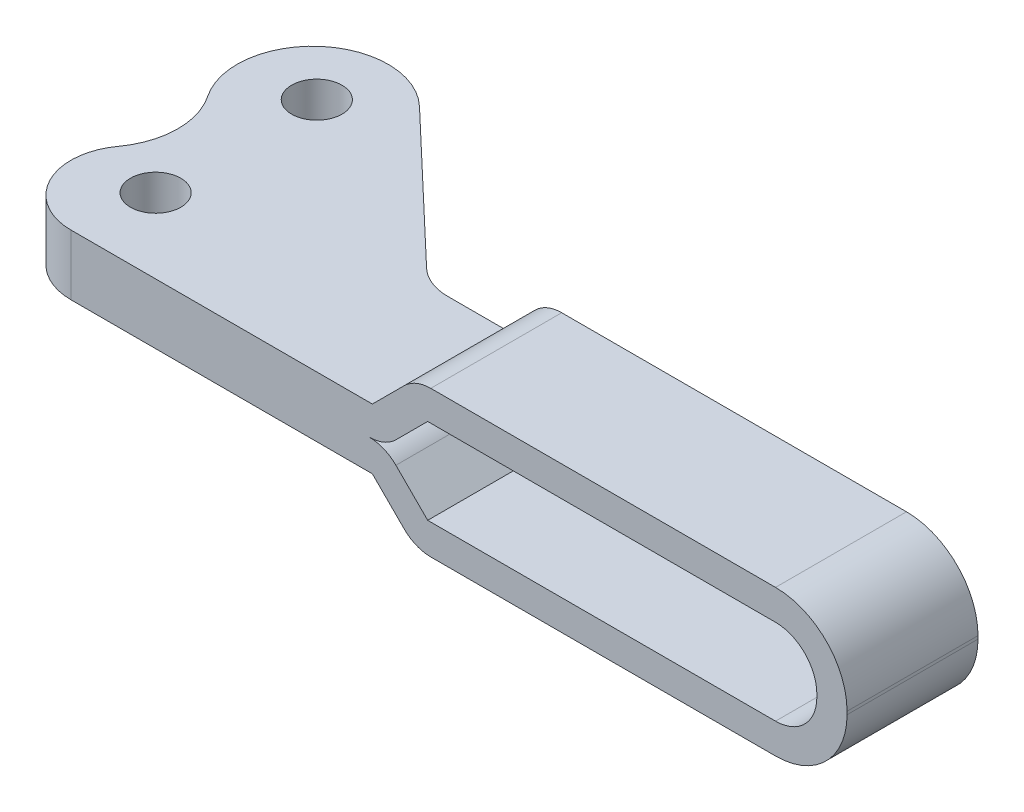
ISO-10303-21;
HEADER;
FILE_DESCRIPTION(('STEP AP214'),'2;1');
FILE_NAME('part.step','',(''),(''),'','','');
FILE_SCHEMA(('AUTOMOTIVE_DESIGN { 1 0 10303 214 1 1 1 1 }'));
ENDSEC;
DATA;
#1=APPLICATION_CONTEXT('core data for automotive mechanical design processes');
#2=APPLICATION_PROTOCOL_DEFINITION('international standard','automotive_design',2000,#1);
#3=PRODUCT_CONTEXT('',#1,'mechanical');
#4=PRODUCT('Part','Part','',(#3));
#5=PRODUCT_RELATED_PRODUCT_CATEGORY('part','',(#4));
#6=PRODUCT_DEFINITION_FORMATION('','',#4);
#7=PRODUCT_DEFINITION_CONTEXT('part definition',#1,'design');
#8=PRODUCT_DEFINITION('design','',#6,#7);
#9=PRODUCT_DEFINITION_SHAPE('','',#8);
#10=(LENGTH_UNIT() NAMED_UNIT(*) SI_UNIT(.MILLI.,.METRE.));
#11=(NAMED_UNIT(*) PLANE_ANGLE_UNIT() SI_UNIT($,.RADIAN.));
#12=(NAMED_UNIT(*) SI_UNIT($,.STERADIAN.) SOLID_ANGLE_UNIT());
#13=UNCERTAINTY_MEASURE_WITH_UNIT(LENGTH_MEASURE(1.E-05),#10,'distance_accuracy_value','');
#14=(GEOMETRIC_REPRESENTATION_CONTEXT(3) GLOBAL_UNCERTAINTY_ASSIGNED_CONTEXT((#13)) GLOBAL_UNIT_ASSIGNED_CONTEXT((#10,
#11,#12)) REPRESENTATION_CONTEXT('',''));
#15=CARTESIAN_POINT('',(0.,0.,0.));
#16=DIRECTION('',(0.,0.,1.));
#17=DIRECTION('',(1.,0.,0.));
#18=AXIS2_PLACEMENT_3D('',#15,#16,#17);
#19=CARTESIAN_POINT('',(-0.999999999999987,3.,1.41));
#20=DIRECTION('',(0.,-1.,0.));
#21=DIRECTION('',(0.,0.,-1.));
#22=AXIS2_PLACEMENT_3D('',#19,#20,#21);
#23=PLANE('',#22);
#24=CARTESIAN_POINT('',(0.,3.,0.));
#25=DIRECTION('',(0.,-1.,0.));
#26=DIRECTION('',(0.,0.,-1.));
#27=AXIS2_PLACEMENT_3D('',#24,#25,#26);
#28=CIRCLE('',#27,2.5);
#29=CARTESIAN_POINT('',(0.,3.,-2.5));
#30=VERTEX_POINT('',#29);
#31=EDGE_CURVE('E722',#30,#30,#28,.T.);
#32=ORIENTED_EDGE('',*,*,#31,.T.);
#33=EDGE_LOOP('',(#32));
#34=FACE_BOUND('',#33,.T.);
#35=CARTESIAN_POINT('',(0.,3.,-16.));
#36=DIRECTION('',(0.,-1.,0.));
#37=DIRECTION('',(0.,0.,-1.));
#38=AXIS2_PLACEMENT_3D('',#35,#36,#37);
#39=CIRCLE('',#38,2.5);
#40=CARTESIAN_POINT('',(0.,3.,-18.5));
#41=VERTEX_POINT('',#40);
#42=EDGE_CURVE('E228',#41,#41,#39,.T.);
#43=ORIENTED_EDGE('',*,*,#42,.T.);
#44=EDGE_LOOP('',(#43));
#45=FACE_BOUND('',#44,.T.);
#46=DIRECTION('',(0.,0.,1.));
#47=VECTOR('',#46,1.);
#48=CARTESIAN_POINT('',(28.9267989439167,3.,7.41));
#49=LINE('',#48,#47);
#50=CARTESIAN_POINT('',(28.9267989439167,3.,-5.59));
#51=VERTEX_POINT('',#50);
#52=CARTESIAN_POINT('',(28.9267989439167,3.,7.41));
#53=VERTEX_POINT('',#52);
#54=EDGE_CURVE('E246',#51,#53,#49,.T.);
#55=ORIENTED_EDGE('',*,*,#54,.F.);
#56=DIRECTION('',(-1.,0.,0.));
#57=VECTOR('',#56,1.);
#58=CARTESIAN_POINT('',(21.3804265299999,3.,-5.59));
#59=LINE('',#58,#57);
#60=CARTESIAN_POINT('',(23.3776196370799,3.,-5.59));
#61=VERTEX_POINT('',#60);
#62=EDGE_CURVE('E260',#51,#61,#59,.T.);
#63=ORIENTED_EDGE('',*,*,#62,.T.);
#64=CARTESIAN_POINT('',(23.3776196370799,3.,-10.59));
#65=DIRECTION('',(0.,-1.,0.));
#66=DIRECTION('',(0.,0.,-1.));
#67=AXIS2_PLACEMENT_3D('',#64,#65,#66);
#68=CIRCLE('',#67,5.);
#69=CARTESIAN_POINT('',(19.9328505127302,3.,-6.96597383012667));
#70=VERTEX_POINT('',#69);
#71=EDGE_CURVE('E364',#61,#70,#68,.T.);
#72=ORIENTED_EDGE('',*,*,#71,.T.);
#73=DIRECTION('',(-0.724805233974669,0.,-0.688953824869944));
#74=VECTOR('',#73,1.);
#75=CARTESIAN_POINT('',(5.6671536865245,3.,-20.5260392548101));
#76=LINE('',#75,#74);
#77=CARTESIAN_POINT('',(5.66715368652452,3.,-20.5260392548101));
#78=VERTEX_POINT('',#77);
#79=EDGE_CURVE('E263',#70,#78,#76,.T.);
#80=ORIENTED_EDGE('',*,*,#79,.T.);
#81=CARTESIAN_POINT('',(0.500000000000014,3.,-15.09));
#82=DIRECTION('',(0.,1.,0.));
#83=DIRECTION('',(0.,0.,-1.));
#84=AXIS2_PLACEMENT_3D('',#81,#82,#83);
#85=CIRCLE('',#84,7.5);
#86=CARTESIAN_POINT('',(-5.70490562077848,3.,-10.8770264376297));
#87=VERTEX_POINT('',#86);
#88=EDGE_CURVE('E266',#78,#87,#85,.T.);
#89=ORIENTED_EDGE('',*,*,#88,.T.);
#90=CARTESIAN_POINT('',(-12.,3.,-6.60281699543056));
#91=DIRECTION('',(0.,-1.,0.));
#92=DIRECTION('',(0.,0.,1.));
#93=AXIS2_PLACEMENT_3D('',#90,#91,#92);
#94=CIRCLE('',#93,7.60901305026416);
#95=CARTESIAN_POINT('',(-5.84972714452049,3.,-2.12272509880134));
#96=VERTEX_POINT('',#95);
#97=EDGE_CURVE('E268',#87,#96,#94,.T.);
#98=ORIENTED_EDGE('',*,*,#97,.T.);
#99=CARTESIAN_POINT('',(-0.999999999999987,3.,1.41));
#100=DIRECTION('',(0.,1.,0.));
#101=DIRECTION('',(0.,0.,-1.));
#102=AXIS2_PLACEMENT_3D('',#99,#100,#101);
#103=CIRCLE('',#102,6.);
#104=CARTESIAN_POINT('',(-0.999999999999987,3.,7.41));
#105=VERTEX_POINT('',#104);
#106=EDGE_CURVE('E270',#96,#105,#103,.T.);
#107=ORIENTED_EDGE('',*,*,#106,.T.);
#108=DIRECTION('',(1.,0.,0.));
#109=VECTOR('',#108,1.);
#110=CARTESIAN_POINT('',(76.0517702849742,3.,7.41));
#111=LINE('',#110,#109);
#112=EDGE_CURVE('E272',#105,#53,#111,.T.);
#113=ORIENTED_EDGE('',*,*,#112,.T.);
#114=EDGE_LOOP('',(#55,#63,#72,#80,#89,#98,#107,#113));
#115=FACE_BOUND('',#114,.T.);
#116=ADVANCED_FACE('F14',(#34,#45,#115),#23,.F.);
#117=CARTESIAN_POINT('',(33.1767989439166,-7.25,-5.59));
#118=DIRECTION('',(0.,-1.,0.));
#119=DIRECTION('',(0.,0.,-1.));
#120=AXIS2_PLACEMENT_3D('',#117,#118,#119);
#121=PLANE('',#120);
#122=DIRECTION('',(1.,0.,0.));
#123=VECTOR('',#122,1.);
#124=CARTESIAN_POINT('',(33.1767989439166,-7.25,-5.59));
#125=LINE('',#124,#123);
#126=CARTESIAN_POINT('',(34.7245493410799,-7.25,-5.59));
#127=VERTEX_POINT('',#126);
#128=CARTESIAN_POINT('',(68.9517702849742,-7.25,-5.59));
#129=VERTEX_POINT('',#128);
#130=EDGE_CURVE('E302',#127,#129,#125,.T.);
#131=ORIENTED_EDGE('',*,*,#130,.T.);
#132=DIRECTION('',(0.,0.,1.));
#133=VECTOR('',#132,1.);
#134=CARTESIAN_POINT('',(68.9517702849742,-7.25,-5.59));
#135=LINE('',#134,#133);
#136=CARTESIAN_POINT('',(68.9517702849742,-7.25,7.41));
#137=VERTEX_POINT('',#136);
#138=EDGE_CURVE('E9',#129,#137,#135,.T.);
#139=ORIENTED_EDGE('',*,*,#138,.T.);
#140=DIRECTION('',(1.,0.,0.));
#141=VECTOR('',#140,1.);
#142=CARTESIAN_POINT('',(33.1767989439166,-7.25,7.41));
#143=LINE('',#142,#141);
#144=CARTESIAN_POINT('',(34.7245493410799,-7.25,7.41));
#145=VERTEX_POINT('',#144);
#146=EDGE_CURVE('E301',#145,#137,#143,.T.);
#147=ORIENTED_EDGE('',*,*,#146,.F.);
#148=DIRECTION('',(0.,0.,1.));
#149=VECTOR('',#148,1.);
#150=CARTESIAN_POINT('',(34.7245493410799,-7.25,-5.59));
#151=LINE('',#150,#149);
#152=EDGE_CURVE('E339',#145,#127,#151,.F.);
#153=ORIENTED_EDGE('',*,*,#152,.T.);
#154=EDGE_LOOP('',(#131,#139,#147,#153));
#155=FACE_BOUND('',#154,.T.);
#156=ADVANCED_FACE('F393',(#155),#121,.T.);
#157=CARTESIAN_POINT('',(28.9267989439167,-3.,-5.59));
#158=DIRECTION('',(-0.707106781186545,-0.70710678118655,0.));
#159=DIRECTION('',(0.707106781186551,-0.707106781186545,0.));
#160=AXIS2_PLACEMENT_3D('',#157,#158,#159);
#161=PLANE('',#160);
#162=DIRECTION('',(0.70710678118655,-0.707106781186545,0.));
#163=VECTOR('',#162,1.);
#164=CARTESIAN_POINT('',(28.9267989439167,-3.,-5.59));
#165=LINE('',#164,#163);
#166=CARTESIAN_POINT('',(28.9267989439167,-3.,-5.59));
#167=VERTEX_POINT('',#166);
#168=CARTESIAN_POINT('',(32.0823741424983,-6.15557519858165,-5.59));
#169=VERTEX_POINT('',#168);
#170=EDGE_CURVE('E308',#167,#169,#165,.T.);
#171=ORIENTED_EDGE('',*,*,#170,.T.);
#172=DIRECTION('',(0.,0.,1.));
#173=VECTOR('',#172,1.);
#174=CARTESIAN_POINT('',(32.0823741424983,-6.15557519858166,-5.59));
#175=LINE('',#174,#173);
#176=CARTESIAN_POINT('',(32.0823741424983,-6.15557519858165,7.41));
#177=VERTEX_POINT('',#176);
#178=EDGE_CURVE('E336',#169,#177,#175,.T.);
#179=ORIENTED_EDGE('',*,*,#178,.T.);
#180=DIRECTION('',(0.70710678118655,-0.707106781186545,0.));
#181=VECTOR('',#180,1.);
#182=CARTESIAN_POINT('',(28.9267989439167,-3.,7.41));
#183=LINE('',#182,#181);
#184=CARTESIAN_POINT('',(28.9267989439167,-3.,7.41));
#185=VERTEX_POINT('',#184);
#186=EDGE_CURVE('E306',#185,#177,#183,.T.);
#187=ORIENTED_EDGE('',*,*,#186,.F.);
#188=DIRECTION('',(0.,0.,1.));
#189=VECTOR('',#188,1.);
#190=CARTESIAN_POINT('',(28.9267989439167,-3.,-5.59));
#191=LINE('',#190,#189);
#192=EDGE_CURVE('E311',#167,#185,#191,.T.);
#193=ORIENTED_EDGE('',*,*,#192,.F.);
#194=EDGE_LOOP('',(#171,#179,#187,#193));
#195=FACE_BOUND('',#194,.T.);
#196=ADVANCED_FACE('F402',(#195),#161,.T.);
#197=CARTESIAN_POINT('',(76.0517702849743,-7.25,-5.59));
#198=DIRECTION('',(1.,0.,0.));
#199=DIRECTION('',(0.,1.,0.));
#200=AXIS2_PLACEMENT_3D('',#197,#198,#199);
#201=PLANE('',#200);
#202=DIRECTION('',(0.,1.,0.));
#203=VECTOR('',#202,1.);
#204=CARTESIAN_POINT('',(76.0517702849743,-7.25,-5.59));
#205=LINE('',#204,#203);
#206=CARTESIAN_POINT('',(76.0517702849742,-0.149999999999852,-5.59));
#207=VERTEX_POINT('',#206);
#208=CARTESIAN_POINT('',(76.0517702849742,0.15000000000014,-5.59));
#209=VERTEX_POINT('',#208);
#210=EDGE_CURVE('E305',#207,#209,#205,.T.);
#211=ORIENTED_EDGE('',*,*,#210,.T.);
#212=DIRECTION('',(0.,0.,-1.));
#213=VECTOR('',#212,1.);
#214=CARTESIAN_POINT('',(76.0517702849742,0.150000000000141,7.41));
#215=LINE('',#214,#213);
#216=CARTESIAN_POINT('',(76.0517702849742,0.15000000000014,7.41));
#217=VERTEX_POINT('',#216);
#218=EDGE_CURVE('E36',#209,#217,#215,.F.);
#219=ORIENTED_EDGE('',*,*,#218,.T.);
#220=DIRECTION('',(0.,1.,0.));
#221=VECTOR('',#220,1.);
#222=CARTESIAN_POINT('',(76.0517702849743,-7.25,7.41));
#223=LINE('',#222,#221);
#224=CARTESIAN_POINT('',(76.0517702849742,-0.149999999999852,7.41));
#225=VERTEX_POINT('',#224);
#226=EDGE_CURVE('E314',#225,#217,#223,.T.);
#227=ORIENTED_EDGE('',*,*,#226,.F.);
#228=DIRECTION('',(0.,0.,1.));
#229=VECTOR('',#228,1.);
#230=CARTESIAN_POINT('',(76.0517702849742,-0.149999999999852,-5.59));
#231=LINE('',#230,#229);
#232=EDGE_CURVE('E373',#225,#207,#231,.F.);
#233=ORIENTED_EDGE('',*,*,#232,.T.);
#234=EDGE_LOOP('',(#211,#219,#227,#233));
#235=FACE_BOUND('',#234,.T.);
#236=ADVANCED_FACE('F389',(#235),#201,.T.);
#237=CARTESIAN_POINT('',(0.,0.,-5.59));
#238=DIRECTION('',(0.,0.,1.));
#239=DIRECTION('',(1.,0.,0.));
#240=AXIS2_PLACEMENT_3D('',#237,#238,#239);
#241=PLANE('',#240);
#242=DIRECTION('',(-0.70710678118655,0.707106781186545,0.));
#243=VECTOR('',#242,1.);
#244=CARTESIAN_POINT('',(34.4194396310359,-4.25,-5.59));
#245=LINE('',#244,#243);
#246=CARTESIAN_POINT('',(34.4194396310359,-4.25,-5.59));
#247=VERTEX_POINT('',#246);
#248=CARTESIAN_POINT('',(31.2638644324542,-1.09442480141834,-5.59));
#249=VERTEX_POINT('',#248);
#250=EDGE_CURVE('E227',#247,#249,#245,.T.);
#251=ORIENTED_EDGE('',*,*,#250,.F.);
#252=DIRECTION('',(-1.,0.,0.));
#253=VECTOR('',#252,1.);
#254=CARTESIAN_POINT('',(73.0517702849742,-4.25,-5.59));
#255=LINE('',#254,#253);
#256=CARTESIAN_POINT('',(68.9517702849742,-4.25,-5.59));
#257=VERTEX_POINT('',#256);
#258=EDGE_CURVE('E202',#257,#247,#255,.T.);
#259=ORIENTED_EDGE('',*,*,#258,.F.);
#260=CARTESIAN_POINT('',(68.9517702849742,-0.15,-5.59));
#261=DIRECTION('',(0.,0.,1.));
#262=DIRECTION('',(1.,0.,0.));
#263=AXIS2_PLACEMENT_3D('',#260,#261,#262);
#264=CIRCLE('',#263,4.1);
#265=CARTESIAN_POINT('',(73.0517702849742,-0.15,-5.59));
#266=VERTEX_POINT('',#265);
#267=EDGE_CURVE('E350',#257,#266,#264,.T.);
#268=ORIENTED_EDGE('',*,*,#267,.T.);
#269=DIRECTION('',(0.,-1.,0.));
#270=VECTOR('',#269,1.);
#271=CARTESIAN_POINT('',(73.0517702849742,4.25,-5.59));
#272=LINE('',#271,#270);
#273=CARTESIAN_POINT('',(73.0517702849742,0.149999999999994,-5.59));
#274=VERTEX_POINT('',#273);
#275=EDGE_CURVE('E196',#274,#266,#272,.T.);
#276=ORIENTED_EDGE('',*,*,#275,.F.);
#277=CARTESIAN_POINT('',(68.9517702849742,0.149999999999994,-5.59));
#278=DIRECTION('',(0.,0.,1.));
#279=DIRECTION('',(1.,0.,0.));
#280=AXIS2_PLACEMENT_3D('',#277,#278,#279);
#281=CIRCLE('',#280,4.1);
#282=CARTESIAN_POINT('',(68.9517702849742,4.25,-5.59));
#283=VERTEX_POINT('',#282);
#284=EDGE_CURVE('E353',#274,#283,#281,.T.);
#285=ORIENTED_EDGE('',*,*,#284,.T.);
#286=DIRECTION('',(1.,0.,0.));
#287=VECTOR('',#286,1.);
#288=CARTESIAN_POINT('',(34.4194396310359,4.25,-5.59));
#289=LINE('',#288,#287);
#290=CARTESIAN_POINT('',(34.4194396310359,4.25,-5.59));
#291=VERTEX_POINT('',#290);
#292=EDGE_CURVE('E239',#291,#283,#289,.T.);
#293=ORIENTED_EDGE('',*,*,#292,.F.);
#294=DIRECTION('',(0.707106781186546,0.707106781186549,0.));
#295=VECTOR('',#294,1.);
#296=CARTESIAN_POINT('',(31.2638644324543,1.09442480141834,-5.59));
#297=LINE('',#296,#295);
#298=CARTESIAN_POINT('',(31.2638644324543,1.09442480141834,-5.59));
#299=VERTEX_POINT('',#298);
#300=EDGE_CURVE('E236',#299,#291,#297,.T.);
#301=ORIENTED_EDGE('',*,*,#300,.F.);
#302=CARTESIAN_POINT('',(28.6216892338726,3.7366,-5.59));
#303=DIRECTION('',(0.,0.,1.));
#304=DIRECTION('',(1.,0.,0.));
#305=AXIS2_PLACEMENT_3D('',#302,#303,#304);
#306=CIRCLE('',#305,3.7366);
#307=CARTESIAN_POINT('',(28.6216892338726,0.,-5.59));
#308=VERTEX_POINT('',#307);
#309=EDGE_CURVE('E233',#308,#299,#306,.T.);
#310=ORIENTED_EDGE('',*,*,#309,.F.);
#311=CARTESIAN_POINT('',(28.6216892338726,-3.7366,-5.59));
#312=DIRECTION('',(0.,0.,1.));
#313=DIRECTION('',(1.,0.,0.));
#314=AXIS2_PLACEMENT_3D('',#311,#312,#313);
#315=CIRCLE('',#314,3.7366);
#316=EDGE_CURVE('E230',#249,#308,#315,.T.);
#317=ORIENTED_EDGE('',*,*,#316,.F.);
#318=EDGE_LOOP('',(#251,#259,#268,#276,#285,#293,#301,#310,#317));
#319=FACE_BOUND('',#318,.T.);
#320=DIRECTION('',(-1.,0.,0.));
#321=VECTOR('',#320,1.);
#322=CARTESIAN_POINT('',(28.9267989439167,7.25,-5.59));
#323=LINE('',#322,#321);
#324=CARTESIAN_POINT('',(68.9517702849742,7.25,-5.59));
#325=VERTEX_POINT('',#324);
#326=CARTESIAN_POINT('',(34.72454934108,7.25,-5.59));
#327=VERTEX_POINT('',#326);
#328=EDGE_CURVE('E255',#325,#327,#323,.T.);
#329=ORIENTED_EDGE('',*,*,#328,.F.);
#330=CARTESIAN_POINT('',(68.9517702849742,0.15,-5.59));
#331=DIRECTION('',(0.,0.,1.));
#332=DIRECTION('',(1.,0.,0.));
#333=AXIS2_PLACEMENT_3D('',#330,#331,#332);
#334=CIRCLE('',#333,7.1);
#335=EDGE_CURVE('E371',#325,#209,#334,.F.);
#336=ORIENTED_EDGE('',*,*,#335,.T.);
#337=ORIENTED_EDGE('',*,*,#210,.F.);
#338=CARTESIAN_POINT('',(68.9517702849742,-0.14999999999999,-5.59));
#339=DIRECTION('',(0.,0.,1.));
#340=DIRECTION('',(1.,0.,0.));
#341=AXIS2_PLACEMENT_3D('',#338,#339,#340);
#342=CIRCLE('',#341,7.1);
#343=EDGE_CURVE('E369',#207,#129,#342,.F.);
#344=ORIENTED_EDGE('',*,*,#343,.T.);
#345=ORIENTED_EDGE('',*,*,#130,.F.);
#346=CARTESIAN_POINT('',(34.7245493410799,-3.5134,-5.59));
#347=DIRECTION('',(0.,0.,1.));
#348=DIRECTION('',(1.,0.,0.));
#349=AXIS2_PLACEMENT_3D('',#346,#347,#348);
#350=CIRCLE('',#349,3.7366);
#351=EDGE_CURVE('E331',#127,#169,#350,.F.);
#352=ORIENTED_EDGE('',*,*,#351,.T.);
#353=ORIENTED_EDGE('',*,*,#170,.F.);
#354=DIRECTION('',(-1.,0.,0.));
#355=VECTOR('',#354,1.);
#356=CARTESIAN_POINT('',(21.3804265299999,-3.,-5.59));
#357=LINE('',#356,#355);
#358=CARTESIAN_POINT('',(23.3776196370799,-3.,-5.59));
#359=VERTEX_POINT('',#358);
#360=EDGE_CURVE('E276',#167,#359,#357,.T.);
#361=ORIENTED_EDGE('',*,*,#360,.T.);
#362=DIRECTION('',(0.,-1.,0.));
#363=VECTOR('',#362,1.);
#364=CARTESIAN_POINT('',(23.3776196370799,3.,-5.59));
#365=LINE('',#364,#363);
#366=EDGE_CURVE('E360',#359,#61,#365,.F.);
#367=ORIENTED_EDGE('',*,*,#366,.T.);
#368=ORIENTED_EDGE('',*,*,#62,.F.);
#369=DIRECTION('',(0.707106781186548,0.707106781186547,0.));
#370=VECTOR('',#369,1.);
#371=CARTESIAN_POINT('',(28.9267989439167,3.,-5.59));
#372=LINE('',#371,#370);
#373=CARTESIAN_POINT('',(32.0823741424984,6.15557519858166,-5.59));
#374=VERTEX_POINT('',#373);
#375=EDGE_CURVE('E257',#374,#51,#372,.F.);
#376=ORIENTED_EDGE('',*,*,#375,.F.);
#377=CARTESIAN_POINT('',(34.72454934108,3.5134,-5.59));
#378=DIRECTION('',(0.,0.,1.));
#379=DIRECTION('',(1.,0.,0.));
#380=AXIS2_PLACEMENT_3D('',#377,#378,#379);
#381=CIRCLE('',#380,3.7366);
#382=EDGE_CURVE('E333',#374,#327,#381,.F.);
#383=ORIENTED_EDGE('',*,*,#382,.T.);
#384=EDGE_LOOP('',(#329,#336,#337,#344,#345,#352,#353,#361,#367,#368,#376,#383));
#385=FACE_BOUND('',#384,.T.);
#386=ADVANCED_FACE('F387',(#319,#385),#241,.F.);
#387=CARTESIAN_POINT('',(0.,0.,7.41));
#388=DIRECTION('',(0.,0.,1.));
#389=DIRECTION('',(1.,0.,0.));
#390=AXIS2_PLACEMENT_3D('',#387,#388,#389);
#391=PLANE('',#390);
#392=DIRECTION('',(0.,-1.,0.));
#393=VECTOR('',#392,1.);
#394=CARTESIAN_POINT('',(73.0517702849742,4.25,7.41));
#395=LINE('',#394,#393);
#396=CARTESIAN_POINT('',(73.0517702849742,0.149999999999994,7.41));
#397=VERTEX_POINT('',#396);
#398=CARTESIAN_POINT('',(73.0517702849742,-0.15,7.41));
#399=VERTEX_POINT('',#398);
#400=EDGE_CURVE('E207',#397,#399,#395,.T.);
#401=ORIENTED_EDGE('',*,*,#400,.T.);
#402=CARTESIAN_POINT('',(68.9517702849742,-0.15,7.41));
#403=DIRECTION('',(0.,0.,1.));
#404=DIRECTION('',(1.,0.,0.));
#405=AXIS2_PLACEMENT_3D('',#402,#403,#404);
#406=CIRCLE('',#405,4.1);
#407=CARTESIAN_POINT('',(68.9517702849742,-4.25,7.41));
#408=VERTEX_POINT('',#407);
#409=EDGE_CURVE('E192',#399,#408,#406,.F.);
#410=ORIENTED_EDGE('',*,*,#409,.T.);
#411=DIRECTION('',(-1.,0.,0.));
#412=VECTOR('',#411,1.);
#413=CARTESIAN_POINT('',(73.0517702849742,-4.25,7.41));
#414=LINE('',#413,#412);
#415=CARTESIAN_POINT('',(34.4194396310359,-4.25,7.41));
#416=VERTEX_POINT('',#415);
#417=EDGE_CURVE('E183',#408,#416,#414,.T.);
#418=ORIENTED_EDGE('',*,*,#417,.T.);
#419=DIRECTION('',(-0.70710678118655,0.707106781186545,0.));
#420=VECTOR('',#419,1.);
#421=CARTESIAN_POINT('',(34.4194396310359,-4.25,7.41));
#422=LINE('',#421,#420);
#423=CARTESIAN_POINT('',(31.2638644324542,-1.09442480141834,7.41));
#424=VERTEX_POINT('',#423);
#425=EDGE_CURVE('E190',#416,#424,#422,.T.);
#426=ORIENTED_EDGE('',*,*,#425,.T.);
#427=CARTESIAN_POINT('',(28.6216892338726,-3.7366,7.41));
#428=DIRECTION('',(0.,0.,1.));
#429=DIRECTION('',(1.,0.,0.));
#430=AXIS2_PLACEMENT_3D('',#427,#428,#429);
#431=CIRCLE('',#430,3.7366);
#432=CARTESIAN_POINT('',(28.6216892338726,0.,7.41));
#433=VERTEX_POINT('',#432);
#434=EDGE_CURVE('E211',#424,#433,#431,.T.);
#435=ORIENTED_EDGE('',*,*,#434,.T.);
#436=CARTESIAN_POINT('',(28.6216892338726,3.7366,7.41));
#437=DIRECTION('',(0.,0.,1.));
#438=DIRECTION('',(1.,0.,0.));
#439=AXIS2_PLACEMENT_3D('',#436,#437,#438);
#440=CIRCLE('',#439,3.7366);
#441=CARTESIAN_POINT('',(31.2638644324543,1.09442480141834,7.41));
#442=VERTEX_POINT('',#441);
#443=EDGE_CURVE('E213',#433,#442,#440,.T.);
#444=ORIENTED_EDGE('',*,*,#443,.T.);
#445=DIRECTION('',(0.707106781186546,0.707106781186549,0.));
#446=VECTOR('',#445,1.);
#447=CARTESIAN_POINT('',(31.2638644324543,1.09442480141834,7.41));
#448=LINE('',#447,#446);
#449=CARTESIAN_POINT('',(34.4194396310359,4.25,7.41));
#450=VERTEX_POINT('',#449);
#451=EDGE_CURVE('E219',#442,#450,#448,.T.);
#452=ORIENTED_EDGE('',*,*,#451,.T.);
#453=DIRECTION('',(1.,0.,0.));
#454=VECTOR('',#453,1.);
#455=CARTESIAN_POINT('',(34.4194396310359,4.25,7.41));
#456=LINE('',#455,#454);
#457=CARTESIAN_POINT('',(68.9517702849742,4.25,7.41));
#458=VERTEX_POINT('',#457);
#459=EDGE_CURVE('E222',#450,#458,#456,.T.);
#460=ORIENTED_EDGE('',*,*,#459,.T.);
#461=CARTESIAN_POINT('',(68.9517702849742,0.149999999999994,7.41));
#462=DIRECTION('',(0.,0.,1.));
#463=DIRECTION('',(1.,0.,0.));
#464=AXIS2_PLACEMENT_3D('',#461,#462,#463);
#465=CIRCLE('',#464,4.1);
#466=EDGE_CURVE('E355',#458,#397,#465,.F.);
#467=ORIENTED_EDGE('',*,*,#466,.T.);
#468=EDGE_LOOP('',(#401,#410,#418,#426,#435,#444,#452,#460,#467));
#469=FACE_BOUND('',#468,.T.);
#470=ORIENTED_EDGE('',*,*,#226,.T.);
#471=CARTESIAN_POINT('',(68.9517702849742,0.15,7.41));
#472=DIRECTION('',(0.,0.,1.));
#473=DIRECTION('',(1.,0.,0.));
#474=AXIS2_PLACEMENT_3D('',#471,#472,#473);
#475=CIRCLE('',#474,7.1);
#476=CARTESIAN_POINT('',(68.9517702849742,7.25,7.41));
#477=VERTEX_POINT('',#476);
#478=EDGE_CURVE('E22',#217,#477,#475,.T.);
#479=ORIENTED_EDGE('',*,*,#478,.T.);
#480=DIRECTION('',(1.,0.,0.));
#481=VECTOR('',#480,1.);
#482=CARTESIAN_POINT('',(76.0517702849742,7.25,7.41));
#483=LINE('',#482,#481);
#484=CARTESIAN_POINT('',(34.72454934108,7.25,7.41));
#485=VERTEX_POINT('',#484);
#486=EDGE_CURVE('E252',#485,#477,#483,.T.);
#487=ORIENTED_EDGE('',*,*,#486,.F.);
#488=CARTESIAN_POINT('',(34.72454934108,3.5134,7.41));
#489=DIRECTION('',(0.,0.,1.));
#490=DIRECTION('',(1.,0.,0.));
#491=AXIS2_PLACEMENT_3D('',#488,#489,#490);
#492=CIRCLE('',#491,3.7366);
#493=CARTESIAN_POINT('',(32.0823741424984,6.15557519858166,7.41));
#494=VERTEX_POINT('',#493);
#495=EDGE_CURVE('E327',#485,#494,#492,.T.);
#496=ORIENTED_EDGE('',*,*,#495,.T.);
#497=DIRECTION('',(0.707106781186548,0.707106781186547,0.));
#498=VECTOR('',#497,1.);
#499=CARTESIAN_POINT('',(28.9267989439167,3.,7.41));
#500=LINE('',#499,#498);
#501=EDGE_CURVE('E280',#494,#53,#500,.F.);
#502=ORIENTED_EDGE('',*,*,#501,.T.);
#503=ORIENTED_EDGE('',*,*,#112,.F.);
#504=DIRECTION('',(0.,-1.,0.));
#505=VECTOR('',#504,1.);
#506=CARTESIAN_POINT('',(-0.999999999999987,3.,7.41));
#507=LINE('',#506,#505);
#508=CARTESIAN_POINT('',(-0.999999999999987,-3.,7.41));
#509=VERTEX_POINT('',#508);
#510=EDGE_CURVE('E275',#105,#509,#507,.T.);
#511=ORIENTED_EDGE('',*,*,#510,.T.);
#512=DIRECTION('',(1.,0.,0.));
#513=VECTOR('',#512,1.);
#514=CARTESIAN_POINT('',(76.0517702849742,-3.,7.41));
#515=LINE('',#514,#513);
#516=EDGE_CURVE('E264',#509,#185,#515,.T.);
#517=ORIENTED_EDGE('',*,*,#516,.T.);
#518=ORIENTED_EDGE('',*,*,#186,.T.);
#519=CARTESIAN_POINT('',(34.7245493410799,-3.5134,7.41));
#520=DIRECTION('',(0.,0.,1.));
#521=DIRECTION('',(1.,0.,0.));
#522=AXIS2_PLACEMENT_3D('',#519,#520,#521);
#523=CIRCLE('',#522,3.7366);
#524=EDGE_CURVE('E325',#177,#145,#523,.T.);
#525=ORIENTED_EDGE('',*,*,#524,.T.);
#526=ORIENTED_EDGE('',*,*,#146,.T.);
#527=CARTESIAN_POINT('',(68.9517702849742,-0.14999999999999,7.41));
#528=DIRECTION('',(0.,0.,1.));
#529=DIRECTION('',(1.,0.,0.));
#530=AXIS2_PLACEMENT_3D('',#527,#528,#529);
#531=CIRCLE('',#530,7.1);
#532=EDGE_CURVE('E29',#137,#225,#531,.T.);
#533=ORIENTED_EDGE('',*,*,#532,.T.);
#534=EDGE_LOOP('',(#470,#479,#487,#496,#502,#503,#511,#517,#518,#525,#526,#533));
#535=FACE_BOUND('',#534,.T.);
#536=ADVANCED_FACE('F186',(#469,#535),#391,.T.);
#537=CARTESIAN_POINT('',(5.6671536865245,3.,-20.5260392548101));
#538=DIRECTION('',(-0.688953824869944,0.,0.724805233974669));
#539=DIRECTION('',(0.724805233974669,0.,0.688953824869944));
#540=AXIS2_PLACEMENT_3D('',#537,#538,#539);
#541=PLANE('',#540);
#542=ORIENTED_EDGE('',*,*,#79,.F.);
#543=DIRECTION('',(0.,-1.,0.));
#544=VECTOR('',#543,1.);
#545=CARTESIAN_POINT('',(19.9328505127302,-3.,-6.96597383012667));
#546=LINE('',#545,#544);
#547=CARTESIAN_POINT('',(19.9328505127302,-3.,-6.96597383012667));
#548=VERTEX_POINT('',#547);
#549=EDGE_CURVE('E357',#70,#548,#546,.T.);
#550=ORIENTED_EDGE('',*,*,#549,.T.);
#551=DIRECTION('',(-0.724805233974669,0.,-0.688953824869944));
#552=VECTOR('',#551,1.);
#553=CARTESIAN_POINT('',(5.6671536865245,-3.,-20.5260392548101));
#554=LINE('',#553,#552);
#555=CARTESIAN_POINT('',(5.66715368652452,-3.,-20.5260392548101));
#556=VERTEX_POINT('',#555);
#557=EDGE_CURVE('E279',#548,#556,#554,.T.);
#558=ORIENTED_EDGE('',*,*,#557,.T.);
#559=DIRECTION('',(0.,-1.,0.));
#560=VECTOR('',#559,1.);
#561=CARTESIAN_POINT('',(5.66715368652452,3.,-20.5260392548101));
#562=LINE('',#561,#560);
#563=EDGE_CURVE('E298',#78,#556,#562,.T.);
#564=ORIENTED_EDGE('',*,*,#563,.F.);
#565=EDGE_LOOP('',(#542,#550,#558,#564));
#566=FACE_BOUND('',#565,.T.);
#567=ADVANCED_FACE('F426',(#566),#541,.F.);
#568=CARTESIAN_POINT('',(0.500000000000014,3.,-15.09));
#569=DIRECTION('',(0.,-1.,0.));
#570=DIRECTION('',(0.,0.,-1.));
#571=AXIS2_PLACEMENT_3D('',#568,#569,#570);
#572=CYLINDRICAL_SURFACE('',#571,7.5);
#573=CARTESIAN_POINT('',(0.500000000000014,-3.,-15.09));
#574=DIRECTION('',(0.,1.,0.));
#575=DIRECTION('',(0.,0.,-1.));
#576=AXIS2_PLACEMENT_3D('',#573,#574,#575);
#577=CIRCLE('',#576,7.5);
#578=CARTESIAN_POINT('',(-5.70490562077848,-3.,-10.8770264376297));
#579=VERTEX_POINT('',#578);
#580=EDGE_CURVE('E282',#556,#579,#577,.T.);
#581=ORIENTED_EDGE('',*,*,#580,.T.);
#582=DIRECTION('',(0.,-1.,0.));
#583=VECTOR('',#582,1.);
#584=CARTESIAN_POINT('',(-5.70490562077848,3.,-10.8770264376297));
#585=LINE('',#584,#583);
#586=EDGE_CURVE('E295',#87,#579,#585,.T.);
#587=ORIENTED_EDGE('',*,*,#586,.F.);
#588=ORIENTED_EDGE('',*,*,#88,.F.);
#589=ORIENTED_EDGE('',*,*,#563,.T.);
#590=EDGE_LOOP('',(#581,#587,#588,#589));
#591=FACE_BOUND('',#590,.T.);
#592=ADVANCED_FACE('F422',(#591),#572,.T.);
#593=CARTESIAN_POINT('',(-12.,3.,-6.60281699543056));
#594=DIRECTION('',(0.,-1.,0.));
#595=DIRECTION('',(0.,0.,-1.));
#596=AXIS2_PLACEMENT_3D('',#593,#594,#595);
#597=CYLINDRICAL_SURFACE('',#596,7.60901305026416);
#598=CARTESIAN_POINT('',(-12.,-3.,-6.60281699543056));
#599=DIRECTION('',(0.,-1.,0.));
#600=DIRECTION('',(0.,0.,1.));
#601=AXIS2_PLACEMENT_3D('',#598,#599,#600);
#602=CIRCLE('',#601,7.60901305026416);
#603=CARTESIAN_POINT('',(-5.84972714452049,-3.,-2.12272509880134));
#604=VERTEX_POINT('',#603);
#605=EDGE_CURVE('E284',#579,#604,#602,.T.);
#606=ORIENTED_EDGE('',*,*,#605,.T.);
#607=DIRECTION('',(0.,-1.,0.));
#608=VECTOR('',#607,1.);
#609=CARTESIAN_POINT('',(-5.84972714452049,3.,-2.12272509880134));
#610=LINE('',#609,#608);
#611=EDGE_CURVE('E292',#96,#604,#610,.T.);
#612=ORIENTED_EDGE('',*,*,#611,.F.);
#613=ORIENTED_EDGE('',*,*,#97,.F.);
#614=ORIENTED_EDGE('',*,*,#586,.T.);
#615=EDGE_LOOP('',(#606,#612,#613,#614));
#616=FACE_BOUND('',#615,.T.);
#617=ADVANCED_FACE('F417',(#616),#597,.F.);
#618=CARTESIAN_POINT('',(-0.999999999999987,3.,1.41));
#619=DIRECTION('',(0.,-1.,0.));
#620=DIRECTION('',(0.,0.,-1.));
#621=AXIS2_PLACEMENT_3D('',#618,#619,#620);
#622=CYLINDRICAL_SURFACE('',#621,6.);
#623=CARTESIAN_POINT('',(-0.999999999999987,-3.,1.41));
#624=DIRECTION('',(0.,1.,0.));
#625=DIRECTION('',(0.,0.,-1.));
#626=AXIS2_PLACEMENT_3D('',#623,#624,#625);
#627=CIRCLE('',#626,6.);
#628=EDGE_CURVE('E286',#604,#509,#627,.T.);
#629=ORIENTED_EDGE('',*,*,#628,.T.);
#630=ORIENTED_EDGE('',*,*,#510,.F.);
#631=ORIENTED_EDGE('',*,*,#106,.F.);
#632=ORIENTED_EDGE('',*,*,#611,.T.);
#633=EDGE_LOOP('',(#629,#630,#631,#632));
#634=FACE_BOUND('',#633,.T.);
#635=ADVANCED_FACE('F411',(#634),#622,.T.);
#636=CARTESIAN_POINT('',(-0.999999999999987,-3.,1.41));
#637=DIRECTION('',(0.,-1.,0.));
#638=DIRECTION('',(0.,0.,-1.));
#639=AXIS2_PLACEMENT_3D('',#636,#637,#638);
#640=PLANE('',#639);
#641=CARTESIAN_POINT('',(0.,-3.,0.));
#642=DIRECTION('',(0.,-1.,0.));
#643=DIRECTION('',(0.,0.,-1.));
#644=AXIS2_PLACEMENT_3D('',#641,#642,#643);
#645=CIRCLE('',#644,2.5);
#646=CARTESIAN_POINT('',(0.,-3.,-2.5));
#647=VERTEX_POINT('',#646);
#648=EDGE_CURVE('E720',#647,#647,#645,.T.);
#649=ORIENTED_EDGE('',*,*,#648,.F.);
#650=EDGE_LOOP('',(#649));
#651=FACE_BOUND('',#650,.T.);
#652=CARTESIAN_POINT('',(0.,-3.,-16.));
#653=DIRECTION('',(0.,-1.,0.));
#654=DIRECTION('',(0.,0.,-1.));
#655=AXIS2_PLACEMENT_3D('',#652,#653,#654);
#656=CIRCLE('',#655,2.5);
#657=CARTESIAN_POINT('',(0.,-3.,-18.5));
#658=VERTEX_POINT('',#657);
#659=EDGE_CURVE('E723',#658,#658,#656,.T.);
#660=ORIENTED_EDGE('',*,*,#659,.F.);
#661=EDGE_LOOP('',(#660));
#662=FACE_BOUND('',#661,.T.);
#663=ORIENTED_EDGE('',*,*,#360,.F.);
#664=ORIENTED_EDGE('',*,*,#192,.T.);
#665=ORIENTED_EDGE('',*,*,#516,.F.);
#666=ORIENTED_EDGE('',*,*,#628,.F.);
#667=ORIENTED_EDGE('',*,*,#605,.F.);
#668=ORIENTED_EDGE('',*,*,#580,.F.);
#669=ORIENTED_EDGE('',*,*,#557,.F.);
#670=CARTESIAN_POINT('',(23.3776196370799,-3.,-10.59));
#671=DIRECTION('',(0.,-1.,0.));
#672=DIRECTION('',(0.,0.,-1.));
#673=AXIS2_PLACEMENT_3D('',#670,#671,#672);
#674=CIRCLE('',#673,5.);
#675=EDGE_CURVE('E362',#548,#359,#674,.F.);
#676=ORIENTED_EDGE('',*,*,#675,.T.);
#677=EDGE_LOOP('',(#663,#664,#665,#666,#667,#668,#669,#676));
#678=FACE_BOUND('',#677,.T.);
#679=ADVANCED_FACE('F405',(#651,#662,#678),#640,.T.);
#680=CARTESIAN_POINT('',(28.9267989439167,3.,7.41));
#681=DIRECTION('',(-0.707106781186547,0.707106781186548,0.));
#682=DIRECTION('',(-0.707106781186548,-0.707106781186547,0.));
#683=AXIS2_PLACEMENT_3D('',#680,#681,#682);
#684=PLANE('',#683);
#685=ORIENTED_EDGE('',*,*,#501,.F.);
#686=DIRECTION('',(0.,0.,1.));
#687=VECTOR('',#686,1.);
#688=CARTESIAN_POINT('',(32.0823741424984,6.15557519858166,7.41));
#689=LINE('',#688,#687);
#690=EDGE_CURVE('E329',#494,#374,#689,.F.);
#691=ORIENTED_EDGE('',*,*,#690,.T.);
#692=ORIENTED_EDGE('',*,*,#375,.T.);
#693=ORIENTED_EDGE('',*,*,#54,.T.);
#694=EDGE_LOOP('',(#685,#691,#692,#693));
#695=FACE_BOUND('',#694,.T.);
#696=ADVANCED_FACE('F442',(#695),#684,.T.);
#697=CARTESIAN_POINT('',(0.,7.25,0.));
#698=DIRECTION('',(0.,-1.,0.));
#699=DIRECTION('',(0.,0.,-1.));
#700=AXIS2_PLACEMENT_3D('',#697,#698,#699);
#701=PLANE('',#700);
#702=ORIENTED_EDGE('',*,*,#486,.T.);
#703=DIRECTION('',(0.,0.,-1.));
#704=VECTOR('',#703,1.);
#705=CARTESIAN_POINT('',(68.9517702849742,7.25,-5.59));
#706=LINE('',#705,#704);
#707=EDGE_CURVE('E366',#477,#325,#706,.T.);
#708=ORIENTED_EDGE('',*,*,#707,.T.);
#709=ORIENTED_EDGE('',*,*,#328,.T.);
#710=DIRECTION('',(0.,0.,-1.));
#711=VECTOR('',#710,1.);
#712=CARTESIAN_POINT('',(34.72454934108,7.25,0.));
#713=LINE('',#712,#711);
#714=EDGE_CURVE('E320',#327,#485,#713,.F.);
#715=ORIENTED_EDGE('',*,*,#714,.T.);
#716=EDGE_LOOP('',(#702,#708,#709,#715));
#717=FACE_BOUND('',#716,.T.);
#718=ADVANCED_FACE('F381',(#717),#701,.F.);
#719=CARTESIAN_POINT('',(73.0517702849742,-4.25,7.41));
#720=DIRECTION('',(0.,-1.,0.));
#721=DIRECTION('',(0.,0.,-1.));
#722=AXIS2_PLACEMENT_3D('',#719,#720,#721);
#723=PLANE('',#722);
#724=ORIENTED_EDGE('',*,*,#417,.F.);
#725=DIRECTION('',(0.,0.,-1.));
#726=VECTOR('',#725,1.);
#727=CARTESIAN_POINT('',(68.9517702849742,-4.25,-5.59));
#728=LINE('',#727,#726);
#729=EDGE_CURVE('E341',#408,#257,#728,.T.);
#730=ORIENTED_EDGE('',*,*,#729,.T.);
#731=ORIENTED_EDGE('',*,*,#258,.T.);
#732=DIRECTION('',(0.,0.,-1.));
#733=VECTOR('',#732,1.);
#734=CARTESIAN_POINT('',(34.4194396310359,-4.25,7.41));
#735=LINE('',#734,#733);
#736=EDGE_CURVE('E199',#416,#247,#735,.T.);
#737=ORIENTED_EDGE('',*,*,#736,.F.);
#738=EDGE_LOOP('',(#724,#730,#731,#737));
#739=FACE_BOUND('',#738,.T.);
#740=ADVANCED_FACE('F200',(#739),#723,.F.);
#741=CARTESIAN_POINT('',(73.0517702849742,4.25,7.41));
#742=DIRECTION('',(1.,0.,0.));
#743=DIRECTION('',(0.,0.,-1.));
#744=AXIS2_PLACEMENT_3D('',#741,#742,#743);
#745=PLANE('',#744);
#746=ORIENTED_EDGE('',*,*,#275,.T.);
#747=DIRECTION('',(0.,0.,-1.));
#748=VECTOR('',#747,1.);
#749=CARTESIAN_POINT('',(73.0517702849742,-0.15,7.41));
#750=LINE('',#749,#748);
#751=EDGE_CURVE('E346',#266,#399,#750,.F.);
#752=ORIENTED_EDGE('',*,*,#751,.T.);
#753=ORIENTED_EDGE('',*,*,#400,.F.);
#754=DIRECTION('',(0.,0.,-1.));
#755=VECTOR('',#754,1.);
#756=CARTESIAN_POINT('',(73.0517702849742,0.149999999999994,-5.59));
#757=LINE('',#756,#755);
#758=EDGE_CURVE('E343',#397,#274,#757,.T.);
#759=ORIENTED_EDGE('',*,*,#758,.T.);
#760=EDGE_LOOP('',(#746,#752,#753,#759));
#761=FACE_BOUND('',#760,.T.);
#762=ADVANCED_FACE('F547',(#761),#745,.F.);
#763=CARTESIAN_POINT('',(34.4194396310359,4.25,7.41));
#764=DIRECTION('',(0.,1.,0.));
#765=DIRECTION('',(-1.,0.,0.));
#766=AXIS2_PLACEMENT_3D('',#763,#764,#765);
#767=PLANE('',#766);
#768=ORIENTED_EDGE('',*,*,#292,.T.);
#769=DIRECTION('',(0.,0.,-1.));
#770=VECTOR('',#769,1.);
#771=CARTESIAN_POINT('',(68.9517702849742,4.25,7.41));
#772=LINE('',#771,#770);
#773=EDGE_CURVE('E348',#283,#458,#772,.F.);
#774=ORIENTED_EDGE('',*,*,#773,.T.);
#775=ORIENTED_EDGE('',*,*,#459,.F.);
#776=DIRECTION('',(0.,0.,-1.));
#777=VECTOR('',#776,1.);
#778=CARTESIAN_POINT('',(34.4194396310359,4.25,7.41));
#779=LINE('',#778,#777);
#780=EDGE_CURVE('E244',#450,#291,#779,.T.);
#781=ORIENTED_EDGE('',*,*,#780,.T.);
#782=EDGE_LOOP('',(#768,#774,#775,#781));
#783=FACE_BOUND('',#782,.T.);
#784=ADVANCED_FACE('F555',(#783),#767,.F.);
#785=CARTESIAN_POINT('',(31.2638644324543,1.09442480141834,7.41));
#786=DIRECTION('',(-0.707106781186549,0.707106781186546,0.));
#787=DIRECTION('',(-0.707106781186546,-0.707106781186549,0.));
#788=AXIS2_PLACEMENT_3D('',#785,#786,#787);
#789=PLANE('',#788);
#790=ORIENTED_EDGE('',*,*,#300,.T.);
#791=ORIENTED_EDGE('',*,*,#780,.F.);
#792=ORIENTED_EDGE('',*,*,#451,.F.);
#793=DIRECTION('',(0.,0.,-1.));
#794=VECTOR('',#793,1.);
#795=CARTESIAN_POINT('',(31.2638644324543,1.09442480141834,7.41));
#796=LINE('',#795,#794);
#797=EDGE_CURVE('E247',#442,#299,#796,.T.);
#798=ORIENTED_EDGE('',*,*,#797,.T.);
#799=EDGE_LOOP('',(#790,#791,#792,#798));
#800=FACE_BOUND('',#799,.T.);
#801=ADVANCED_FACE('F565',(#800),#789,.F.);
#802=CARTESIAN_POINT('',(28.6216892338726,3.7366,7.41));
#803=DIRECTION('',(0.,0.,-1.));
#804=DIRECTION('',(-1.,0.,0.));
#805=AXIS2_PLACEMENT_3D('',#802,#803,#804);
#806=CYLINDRICAL_SURFACE('',#805,3.7366);
#807=ORIENTED_EDGE('',*,*,#309,.T.);
#808=ORIENTED_EDGE('',*,*,#797,.F.);
#809=ORIENTED_EDGE('',*,*,#443,.F.);
#810=DIRECTION('',(0.,0.,-1.));
#811=VECTOR('',#810,1.);
#812=CARTESIAN_POINT('',(28.6216892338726,0.,7.41));
#813=LINE('',#812,#811);
#814=EDGE_CURVE('E249',#433,#308,#813,.T.);
#815=ORIENTED_EDGE('',*,*,#814,.T.);
#816=EDGE_LOOP('',(#807,#808,#809,#815));
#817=FACE_BOUND('',#816,.T.);
#818=ADVANCED_FACE('F575',(#817),#806,.T.);
#819=CARTESIAN_POINT('',(28.6216892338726,-3.7366,7.41));
#820=DIRECTION('',(0.,0.,-1.));
#821=DIRECTION('',(-1.,0.,0.));
#822=AXIS2_PLACEMENT_3D('',#819,#820,#821);
#823=CYLINDRICAL_SURFACE('',#822,3.7366);
#824=ORIENTED_EDGE('',*,*,#316,.T.);
#825=ORIENTED_EDGE('',*,*,#814,.F.);
#826=ORIENTED_EDGE('',*,*,#434,.F.);
#827=DIRECTION('',(0.,0.,-1.));
#828=VECTOR('',#827,1.);
#829=CARTESIAN_POINT('',(31.2638644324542,-1.09442480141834,7.41));
#830=LINE('',#829,#828);
#831=EDGE_CURVE('E206',#424,#249,#830,.T.);
#832=ORIENTED_EDGE('',*,*,#831,.T.);
#833=EDGE_LOOP('',(#824,#825,#826,#832));
#834=FACE_BOUND('',#833,.T.);
#835=ADVANCED_FACE('F585',(#834),#823,.T.);
#836=CARTESIAN_POINT('',(34.4194396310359,-4.25,7.41));
#837=DIRECTION('',(-0.707106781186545,-0.70710678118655,0.));
#838=DIRECTION('',(0.70710678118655,-0.707106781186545,0.));
#839=AXIS2_PLACEMENT_3D('',#836,#837,#838);
#840=PLANE('',#839);
#841=ORIENTED_EDGE('',*,*,#250,.T.);
#842=ORIENTED_EDGE('',*,*,#831,.F.);
#843=ORIENTED_EDGE('',*,*,#425,.F.);
#844=ORIENTED_EDGE('',*,*,#736,.T.);
#845=EDGE_LOOP('',(#841,#842,#843,#844));
#846=FACE_BOUND('',#845,.T.);
#847=ADVANCED_FACE('F210',(#846),#840,.F.);
#848=CARTESIAN_POINT('',(0.,-3.,-16.));
#849=DIRECTION('',(0.,-1.,0.));
#850=DIRECTION('',(0.,0.,-1.));
#851=AXIS2_PLACEMENT_3D('',#848,#849,#850);
#852=CYLINDRICAL_SURFACE('',#851,2.5);
#853=ORIENTED_EDGE('',*,*,#659,.T.);
#854=EDGE_LOOP('',(#853));
#855=FACE_BOUND('',#854,.T.);
#856=ORIENTED_EDGE('',*,*,#42,.F.);
#857=EDGE_LOOP('',(#856));
#858=FACE_BOUND('',#857,.T.);
#859=ADVANCED_FACE('F604',(#855,#858),#852,.F.);
#860=CARTESIAN_POINT('',(0.,-3.,0.));
#861=DIRECTION('',(0.,-1.,0.));
#862=DIRECTION('',(0.,0.,-1.));
#863=AXIS2_PLACEMENT_3D('',#860,#861,#862);
#864=CYLINDRICAL_SURFACE('',#863,2.5);
#865=ORIENTED_EDGE('',*,*,#648,.T.);
#866=EDGE_LOOP('',(#865));
#867=FACE_BOUND('',#866,.T.);
#868=ORIENTED_EDGE('',*,*,#31,.F.);
#869=EDGE_LOOP('',(#868));
#870=FACE_BOUND('',#869,.T.);
#871=ADVANCED_FACE('F613',(#867,#870),#864,.F.);
#872=CARTESIAN_POINT('',(34.72454934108,3.5134,0.));
#873=DIRECTION('',(0.,0.,-1.));
#874=DIRECTION('',(-1.,0.,0.));
#875=AXIS2_PLACEMENT_3D('',#872,#873,#874);
#876=CYLINDRICAL_SURFACE('',#875,3.7366);
#877=ORIENTED_EDGE('',*,*,#382,.F.);
#878=ORIENTED_EDGE('',*,*,#690,.F.);
#879=ORIENTED_EDGE('',*,*,#495,.F.);
#880=ORIENTED_EDGE('',*,*,#714,.F.);
#881=EDGE_LOOP('',(#877,#878,#879,#880));
#882=FACE_BOUND('',#881,.T.);
#883=ADVANCED_FACE('F440',(#882),#876,.T.);
#884=CARTESIAN_POINT('',(34.7245493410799,-3.5134,-5.59));
#885=DIRECTION('',(0.,0.,1.));
#886=DIRECTION('',(1.,0.,0.));
#887=AXIS2_PLACEMENT_3D('',#884,#885,#886);
#888=CYLINDRICAL_SURFACE('',#887,3.7366);
#889=ORIENTED_EDGE('',*,*,#351,.F.);
#890=ORIENTED_EDGE('',*,*,#152,.F.);
#891=ORIENTED_EDGE('',*,*,#524,.F.);
#892=ORIENTED_EDGE('',*,*,#178,.F.);
#893=EDGE_LOOP('',(#889,#890,#891,#892));
#894=FACE_BOUND('',#893,.T.);
#895=ADVANCED_FACE('F397',(#894),#888,.T.);
#896=CARTESIAN_POINT('',(68.9517702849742,-0.15,7.41));
#897=DIRECTION('',(0.,0.,1.));
#898=DIRECTION('',(1.,0.,0.));
#899=AXIS2_PLACEMENT_3D('',#896,#897,#898);
#900=CYLINDRICAL_SURFACE('',#899,4.1);
#901=ORIENTED_EDGE('',*,*,#409,.F.);
#902=ORIENTED_EDGE('',*,*,#751,.F.);
#903=ORIENTED_EDGE('',*,*,#267,.F.);
#904=ORIENTED_EDGE('',*,*,#729,.F.);
#905=EDGE_LOOP('',(#901,#902,#903,#904));
#906=FACE_BOUND('',#905,.T.);
#907=ADVANCED_FACE('F639',(#906),#900,.F.);
#908=CARTESIAN_POINT('',(68.9517702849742,0.149999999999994,7.41));
#909=DIRECTION('',(0.,0.,1.));
#910=DIRECTION('',(1.,0.,0.));
#911=AXIS2_PLACEMENT_3D('',#908,#909,#910);
#912=CYLINDRICAL_SURFACE('',#911,4.1);
#913=ORIENTED_EDGE('',*,*,#466,.F.);
#914=ORIENTED_EDGE('',*,*,#773,.F.);
#915=ORIENTED_EDGE('',*,*,#284,.F.);
#916=ORIENTED_EDGE('',*,*,#758,.F.);
#917=EDGE_LOOP('',(#913,#914,#915,#916));
#918=FACE_BOUND('',#917,.T.);
#919=ADVANCED_FACE('F648',(#918),#912,.F.);
#920=CARTESIAN_POINT('',(23.3776196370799,3.,-10.59));
#921=DIRECTION('',(0.,1.,0.));
#922=DIRECTION('',(0.,0.,1.));
#923=AXIS2_PLACEMENT_3D('',#920,#921,#922);
#924=CYLINDRICAL_SURFACE('',#923,5.);
#925=ORIENTED_EDGE('',*,*,#71,.F.);
#926=ORIENTED_EDGE('',*,*,#366,.F.);
#927=ORIENTED_EDGE('',*,*,#675,.F.);
#928=ORIENTED_EDGE('',*,*,#549,.F.);
#929=EDGE_LOOP('',(#925,#926,#927,#928));
#930=FACE_BOUND('',#929,.T.);
#931=ADVANCED_FACE('F432',(#930),#924,.F.);
#932=CARTESIAN_POINT('',(68.9517702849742,0.15,0.));
#933=DIRECTION('',(0.,0.,1.));
#934=DIRECTION('',(1.,0.,0.));
#935=AXIS2_PLACEMENT_3D('',#932,#933,#934);
#936=CYLINDRICAL_SURFACE('',#935,7.1);
#937=ORIENTED_EDGE('',*,*,#478,.F.);
#938=ORIENTED_EDGE('',*,*,#218,.F.);
#939=ORIENTED_EDGE('',*,*,#335,.F.);
#940=ORIENTED_EDGE('',*,*,#707,.F.);
#941=EDGE_LOOP('',(#937,#938,#939,#940));
#942=FACE_BOUND('',#941,.T.);
#943=ADVANCED_FACE('F384',(#942),#936,.T.);
#944=CARTESIAN_POINT('',(68.9517702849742,-0.14999999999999,-5.59));
#945=DIRECTION('',(0.,0.,1.));
#946=DIRECTION('',(1.,0.,0.));
#947=AXIS2_PLACEMENT_3D('',#944,#945,#946);
#948=CYLINDRICAL_SURFACE('',#947,7.1);
#949=ORIENTED_EDGE('',*,*,#343,.F.);
#950=ORIENTED_EDGE('',*,*,#232,.F.);
#951=ORIENTED_EDGE('',*,*,#532,.F.);
#952=ORIENTED_EDGE('',*,*,#138,.F.);
#953=EDGE_LOOP('',(#949,#950,#951,#952));
#954=FACE_BOUND('',#953,.T.);
#955=ADVANCED_FACE('F16',(#954),#948,.T.);
#956=CLOSED_SHELL('',(#116,#156,#196,#236,#386,#536,#567,#592,#617,#635,#679,#696,#718,#740,
#762,#784,#801,#818,#835,#847,#859,#871,#883,#895,#907,#919,#931,#943,#955));
#957=MANIFOLD_SOLID_BREP('B1',#956);
#958=ADVANCED_BREP_SHAPE_REPRESENTATION('',(#18,#957),#14);
#959=SHAPE_DEFINITION_REPRESENTATION(#9,#958);
ENDSEC;
END-ISO-10303-21;
